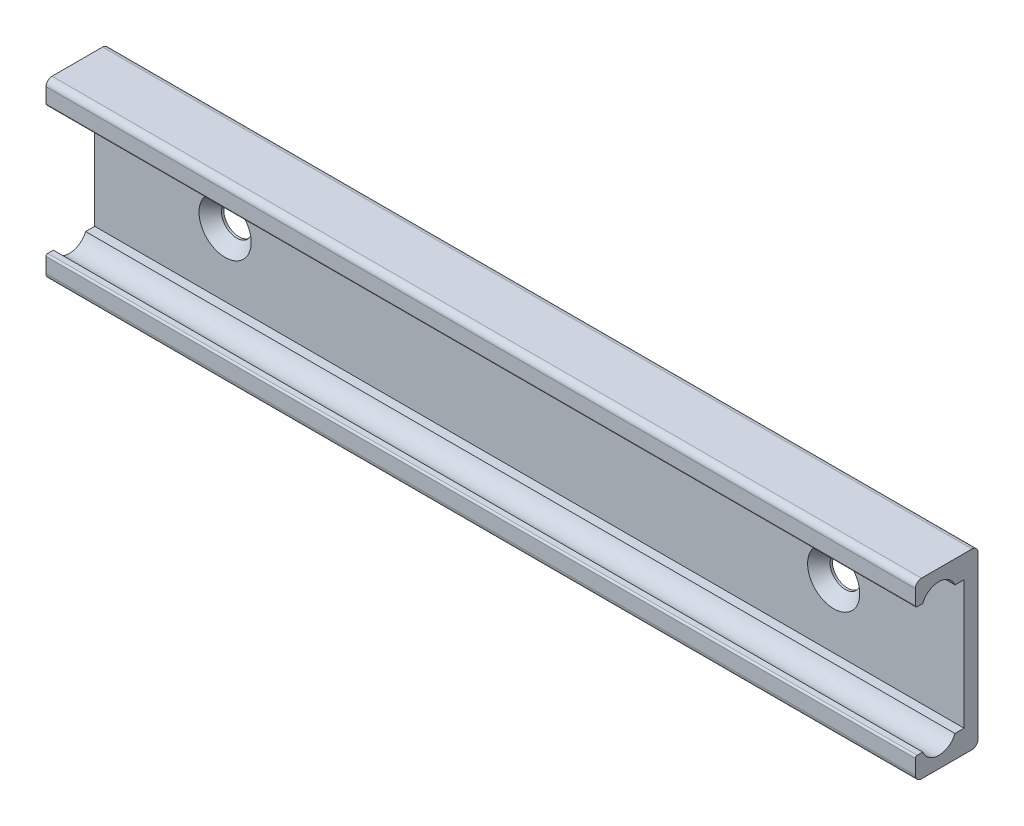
ISO-10303-21;
HEADER;
FILE_DESCRIPTION(('STEP AP214'),'2;1');
FILE_NAME('part.step','',(''),(''),'','','');
FILE_SCHEMA(('AUTOMOTIVE_DESIGN { 1 0 10303 214 1 1 1 1 }'));
ENDSEC;
DATA;
#1=APPLICATION_CONTEXT('core data for automotive mechanical design processes');
#2=APPLICATION_PROTOCOL_DEFINITION('international standard','automotive_design',2000,#1);
#3=PRODUCT_CONTEXT('',#1,'mechanical');
#4=PRODUCT('Part','Part','',(#3));
#5=PRODUCT_RELATED_PRODUCT_CATEGORY('part','',(#4));
#6=PRODUCT_DEFINITION_FORMATION('','',#4);
#7=PRODUCT_DEFINITION_CONTEXT('part definition',#1,'design');
#8=PRODUCT_DEFINITION('design','',#6,#7);
#9=PRODUCT_DEFINITION_SHAPE('','',#8);
#10=(LENGTH_UNIT() NAMED_UNIT(*) SI_UNIT(.MILLI.,.METRE.));
#11=(NAMED_UNIT(*) PLANE_ANGLE_UNIT() SI_UNIT($,.RADIAN.));
#12=(NAMED_UNIT(*) SI_UNIT($,.STERADIAN.) SOLID_ANGLE_UNIT());
#13=UNCERTAINTY_MEASURE_WITH_UNIT(LENGTH_MEASURE(1.E-05),#10,'distance_accuracy_value','');
#14=(GEOMETRIC_REPRESENTATION_CONTEXT(3) GLOBAL_UNCERTAINTY_ASSIGNED_CONTEXT((#13)) GLOBAL_UNIT_ASSIGNED_CONTEXT((#10,
#11,#12)) REPRESENTATION_CONTEXT('',''));
#15=CARTESIAN_POINT('',(0.,0.,0.));
#16=DIRECTION('',(0.,0.,1.));
#17=DIRECTION('',(1.,0.,0.));
#18=AXIS2_PLACEMENT_3D('',#15,#16,#17);
#19=CARTESIAN_POINT('',(85.,9.3,6.49999999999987));
#20=DIRECTION('',(-1.,0.,0.));
#21=DIRECTION('',(0.,0.,1.));
#22=AXIS2_PLACEMENT_3D('',#19,#20,#21);
#23=CYLINDRICAL_SURFACE('',#22,0.7);
#24=CARTESIAN_POINT('',(-15.,9.3,6.49999999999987));
#25=DIRECTION('',(-1.,0.,0.));
#26=DIRECTION('',(0.,0.,-1.));
#27=AXIS2_PLACEMENT_3D('',#24,#25,#26);
#28=CIRCLE('',#27,0.7);
#29=CARTESIAN_POINT('',(-15.,9.3,7.19999999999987));
#30=VERTEX_POINT('',#29);
#31=CARTESIAN_POINT('',(-15.,10.,6.49999999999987));
#32=VERTEX_POINT('',#31);
#33=EDGE_CURVE('E139',#30,#32,#28,.T.);
#34=ORIENTED_EDGE('',*,*,#33,.F.);
#35=DIRECTION('',(-1.,0.,0.));
#36=VECTOR('',#35,1.);
#37=CARTESIAN_POINT('',(85.,9.3,7.19999999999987));
#38=LINE('',#37,#36);
#39=CARTESIAN_POINT('',(85.,9.3,7.19999999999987));
#40=VERTEX_POINT('',#39);
#41=EDGE_CURVE('E9',#40,#30,#38,.T.);
#42=ORIENTED_EDGE('',*,*,#41,.F.);
#43=CARTESIAN_POINT('',(85.,9.3,6.49999999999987));
#44=DIRECTION('',(-1.,0.,0.));
#45=DIRECTION('',(0.,0.,-1.));
#46=AXIS2_PLACEMENT_3D('',#43,#44,#45);
#47=CIRCLE('',#46,0.7);
#48=CARTESIAN_POINT('',(85.,10.,6.49999999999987));
#49=VERTEX_POINT('',#48);
#50=EDGE_CURVE('E141',#40,#49,#47,.T.);
#51=ORIENTED_EDGE('',*,*,#50,.T.);
#52=DIRECTION('',(-1.,0.,0.));
#53=VECTOR('',#52,1.);
#54=CARTESIAN_POINT('',(85.,10.,6.49999999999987));
#55=LINE('',#54,#53);
#56=EDGE_CURVE('E136',#49,#32,#55,.T.);
#57=ORIENTED_EDGE('',*,*,#56,.T.);
#58=EDGE_LOOP('',(#34,#42,#51,#57));
#59=FACE_BOUND('',#58,.T.);
#60=ADVANCED_FACE('F14',(#59),#23,.T.);
#61=CARTESIAN_POINT('',(85.,7.60000008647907,7.19999999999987));
#62=DIRECTION('',(0.,0.,1.));
#63=DIRECTION('',(1.,0.,0.));
#64=AXIS2_PLACEMENT_3D('',#61,#62,#63);
#65=PLANE('',#64);
#66=DIRECTION('',(0.,1.,0.));
#67=VECTOR('',#66,1.);
#68=CARTESIAN_POINT('',(-15.,7.60000008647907,7.19999999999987));
#69=LINE('',#68,#67);
#70=CARTESIAN_POINT('',(-15.,7.60000008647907,7.19999999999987));
#71=VERTEX_POINT('',#70);
#72=EDGE_CURVE('E158',#71,#30,#69,.T.);
#73=ORIENTED_EDGE('',*,*,#72,.F.);
#74=DIRECTION('',(-1.,0.,0.));
#75=VECTOR('',#74,1.);
#76=CARTESIAN_POINT('',(85.,7.60000008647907,7.19999999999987));
#77=LINE('',#76,#75);
#78=CARTESIAN_POINT('',(85.,7.60000008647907,7.19999999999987));
#79=VERTEX_POINT('',#78);
#80=EDGE_CURVE('E22',#79,#71,#77,.T.);
#81=ORIENTED_EDGE('',*,*,#80,.F.);
#82=DIRECTION('',(0.,1.,0.));
#83=VECTOR('',#82,1.);
#84=CARTESIAN_POINT('',(85.,7.60000008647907,7.19999999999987));
#85=LINE('',#84,#83);
#86=EDGE_CURVE('E146',#79,#40,#85,.T.);
#87=ORIENTED_EDGE('',*,*,#86,.T.);
#88=ORIENTED_EDGE('',*,*,#41,.T.);
#89=EDGE_LOOP('',(#73,#81,#87,#88));
#90=FACE_BOUND('',#89,.T.);
#91=ADVANCED_FACE('F319',(#90),#65,.T.);
#92=CARTESIAN_POINT('',(85.,7.60000008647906,6.99999999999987));
#93=DIRECTION('',(-1.,0.,0.));
#94=DIRECTION('',(0.,0.,1.));
#95=AXIS2_PLACEMENT_3D('',#92,#93,#94);
#96=CYLINDRICAL_SURFACE('',#95,0.2);
#97=CARTESIAN_POINT('',(-15.,7.60000008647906,6.99999999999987));
#98=DIRECTION('',(-1.,0.,0.));
#99=DIRECTION('',(0.,0.,-1.));
#100=AXIS2_PLACEMENT_3D('',#97,#98,#99);
#101=CIRCLE('',#100,0.2);
#102=CARTESIAN_POINT('',(-15.,7.40000008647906,6.99999999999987));
#103=VERTEX_POINT('',#102);
#104=EDGE_CURVE('E206',#103,#71,#101,.T.);
#105=ORIENTED_EDGE('',*,*,#104,.F.);
#106=DIRECTION('',(-1.,0.,0.));
#107=VECTOR('',#106,1.);
#108=CARTESIAN_POINT('',(85.,7.40000008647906,6.99999999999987));
#109=LINE('',#108,#107);
#110=CARTESIAN_POINT('',(85.,7.40000008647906,6.99999999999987));
#111=VERTEX_POINT('',#110);
#112=EDGE_CURVE('E258',#111,#103,#109,.T.);
#113=ORIENTED_EDGE('',*,*,#112,.F.);
#114=CARTESIAN_POINT('',(85.,7.60000008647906,6.99999999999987));
#115=DIRECTION('',(-1.,0.,0.));
#116=DIRECTION('',(0.,0.,-1.));
#117=AXIS2_PLACEMENT_3D('',#114,#115,#116);
#118=CIRCLE('',#117,0.2);
#119=EDGE_CURVE('E254',#111,#79,#118,.T.);
#120=ORIENTED_EDGE('',*,*,#119,.T.);
#121=ORIENTED_EDGE('',*,*,#80,.T.);
#122=EDGE_LOOP('',(#105,#113,#120,#121));
#123=FACE_BOUND('',#122,.T.);
#124=ADVANCED_FACE('F324',(#123),#96,.T.);
#125=CARTESIAN_POINT('',(85.,7.40000008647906,6.35404949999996));
#126=DIRECTION('',(0.,-1.,0.));
#127=DIRECTION('',(1.,0.,0.));
#128=AXIS2_PLACEMENT_3D('',#125,#126,#127);
#129=PLANE('',#128);
#130=DIRECTION('',(0.,0.,1.));
#131=VECTOR('',#130,1.);
#132=CARTESIAN_POINT('',(-15.,7.40000008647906,6.35404949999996));
#133=LINE('',#132,#131);
#134=CARTESIAN_POINT('',(-15.,7.40000008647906,6.35404949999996));
#135=VERTEX_POINT('',#134);
#136=EDGE_CURVE('E203',#135,#103,#133,.T.);
#137=ORIENTED_EDGE('',*,*,#136,.F.);
#138=DIRECTION('',(-1.,0.,0.));
#139=VECTOR('',#138,1.);
#140=CARTESIAN_POINT('',(85.,7.40000008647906,6.35404949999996));
#141=LINE('',#140,#139);
#142=CARTESIAN_POINT('',(85.,7.40000008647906,6.35404949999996));
#143=VERTEX_POINT('',#142);
#144=EDGE_CURVE('E260',#143,#135,#141,.T.);
#145=ORIENTED_EDGE('',*,*,#144,.F.);
#146=DIRECTION('',(0.,0.,1.));
#147=VECTOR('',#146,1.);
#148=CARTESIAN_POINT('',(85.,7.40000008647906,6.35404949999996));
#149=LINE('',#148,#147);
#150=EDGE_CURVE('E251',#143,#111,#149,.T.);
#151=ORIENTED_EDGE('',*,*,#150,.T.);
#152=ORIENTED_EDGE('',*,*,#112,.T.);
#153=EDGE_LOOP('',(#137,#145,#151,#152));
#154=FACE_BOUND('',#153,.T.);
#155=ADVANCED_FACE('F330',(#154),#129,.T.);
#156=CARTESIAN_POINT('',(85.,6.65000008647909,4.50000000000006));
#157=DIRECTION('',(-1.,0.,0.));
#158=DIRECTION('',(0.,0.,1.));
#159=AXIS2_PLACEMENT_3D('',#156,#157,#158);
#160=CYLINDRICAL_SURFACE('',#159,1.99999988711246);
#161=CARTESIAN_POINT('',(-15.,6.65000008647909,4.50000000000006));
#162=DIRECTION('',(1.,0.,0.));
#163=DIRECTION('',(0.,0.,1.));
#164=AXIS2_PLACEMENT_3D('',#161,#162,#163);
#165=CIRCLE('',#164,1.99999988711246);
#166=CARTESIAN_POINT('',(-15.,7.40000008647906,2.64595050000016));
#167=VERTEX_POINT('',#166);
#168=EDGE_CURVE('E200',#167,#135,#165,.T.);
#169=ORIENTED_EDGE('',*,*,#168,.F.);
#170=DIRECTION('',(-1.,0.,0.));
#171=VECTOR('',#170,1.);
#172=CARTESIAN_POINT('',(85.,7.40000008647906,2.64595050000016));
#173=LINE('',#172,#171);
#174=CARTESIAN_POINT('',(85.,7.40000008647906,2.64595050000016));
#175=VERTEX_POINT('',#174);
#176=EDGE_CURVE('E262',#175,#167,#173,.T.);
#177=ORIENTED_EDGE('',*,*,#176,.F.);
#178=CARTESIAN_POINT('',(85.,6.65000008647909,4.50000000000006));
#179=DIRECTION('',(1.,0.,0.));
#180=DIRECTION('',(0.,0.,1.));
#181=AXIS2_PLACEMENT_3D('',#178,#179,#180);
#182=CIRCLE('',#181,1.99999988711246);
#183=EDGE_CURVE('E248',#175,#143,#182,.T.);
#184=ORIENTED_EDGE('',*,*,#183,.T.);
#185=ORIENTED_EDGE('',*,*,#144,.T.);
#186=EDGE_LOOP('',(#169,#177,#184,#185));
#187=FACE_BOUND('',#186,.T.);
#188=ADVANCED_FACE('F339',(#187),#160,.F.);
#189=CARTESIAN_POINT('',(85.,7.40000008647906,1.60000000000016));
#190=DIRECTION('',(0.,-1.,0.));
#191=DIRECTION('',(1.,0.,0.));
#192=AXIS2_PLACEMENT_3D('',#189,#190,#191);
#193=PLANE('',#192);
#194=DIRECTION('',(0.,0.,1.));
#195=VECTOR('',#194,1.);
#196=CARTESIAN_POINT('',(-15.,7.40000008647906,1.60000000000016));
#197=LINE('',#196,#195);
#198=CARTESIAN_POINT('',(-15.,7.40000008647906,1.60000000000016));
#199=VERTEX_POINT('',#198);
#200=EDGE_CURVE('E197',#199,#167,#197,.T.);
#201=ORIENTED_EDGE('',*,*,#200,.F.);
#202=DIRECTION('',(-1.,0.,0.));
#203=VECTOR('',#202,1.);
#204=CARTESIAN_POINT('',(85.,7.40000008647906,1.60000000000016));
#205=LINE('',#204,#203);
#206=CARTESIAN_POINT('',(85.,7.40000008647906,1.60000000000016));
#207=VERTEX_POINT('',#206);
#208=EDGE_CURVE('E264',#207,#199,#205,.T.);
#209=ORIENTED_EDGE('',*,*,#208,.F.);
#210=DIRECTION('',(0.,0.,1.));
#211=VECTOR('',#210,1.);
#212=CARTESIAN_POINT('',(85.,7.40000008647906,1.60000000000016));
#213=LINE('',#212,#211);
#214=EDGE_CURVE('E245',#207,#175,#213,.T.);
#215=ORIENTED_EDGE('',*,*,#214,.T.);
#216=ORIENTED_EDGE('',*,*,#176,.T.);
#217=EDGE_LOOP('',(#201,#209,#215,#216));
#218=FACE_BOUND('',#217,.T.);
#219=ADVANCED_FACE('F343',(#218),#193,.T.);
#220=CARTESIAN_POINT('',(85.,-7.40000008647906,1.60000000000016));
#221=DIRECTION('',(0.,0.,1.));
#222=DIRECTION('',(0.,1.,0.));
#223=AXIS2_PLACEMENT_3D('',#220,#221,#222);
#224=PLANE('',#223);
#225=CARTESIAN_POINT('',(70.,0.,1.60000000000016));
#226=DIRECTION('',(0.,0.,1.));
#227=DIRECTION('',(0.,1.,0.));
#228=AXIS2_PLACEMENT_3D('',#225,#226,#227);
#229=CIRCLE('',#228,3.);
#230=CARTESIAN_POINT('',(70.,3.,1.60000000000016));
#231=VERTEX_POINT('',#230);
#232=EDGE_CURVE('E291',#231,#231,#229,.T.);
#233=ORIENTED_EDGE('',*,*,#232,.F.);
#234=EDGE_LOOP('',(#233));
#235=FACE_BOUND('',#234,.T.);
#236=CARTESIAN_POINT('',(0.,0.,1.60000000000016));
#237=DIRECTION('',(0.,0.,1.));
#238=DIRECTION('',(0.,1.,0.));
#239=AXIS2_PLACEMENT_3D('',#236,#237,#238);
#240=CIRCLE('',#239,3.);
#241=CARTESIAN_POINT('',(0.,3.,1.60000000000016));
#242=VERTEX_POINT('',#241);
#243=EDGE_CURVE('E159',#242,#242,#240,.T.);
#244=ORIENTED_EDGE('',*,*,#243,.F.);
#245=EDGE_LOOP('',(#244));
#246=FACE_BOUND('',#245,.T.);
#247=DIRECTION('',(0.,1.,0.));
#248=VECTOR('',#247,1.);
#249=CARTESIAN_POINT('',(-15.,-7.40000008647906,1.60000000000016));
#250=LINE('',#249,#248);
#251=CARTESIAN_POINT('',(-15.,-7.40000008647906,1.60000000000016));
#252=VERTEX_POINT('',#251);
#253=EDGE_CURVE('E194',#252,#199,#250,.T.);
#254=ORIENTED_EDGE('',*,*,#253,.F.);
#255=DIRECTION('',(-1.,0.,0.));
#256=VECTOR('',#255,1.);
#257=CARTESIAN_POINT('',(85.,-7.40000008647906,1.60000000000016));
#258=LINE('',#257,#256);
#259=CARTESIAN_POINT('',(85.,-7.40000008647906,1.60000000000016));
#260=VERTEX_POINT('',#259);
#261=EDGE_CURVE('E266',#260,#252,#258,.T.);
#262=ORIENTED_EDGE('',*,*,#261,.F.);
#263=DIRECTION('',(0.,1.,0.));
#264=VECTOR('',#263,1.);
#265=CARTESIAN_POINT('',(85.,-7.40000008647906,1.60000000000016));
#266=LINE('',#265,#264);
#267=EDGE_CURVE('E242',#260,#207,#266,.T.);
#268=ORIENTED_EDGE('',*,*,#267,.T.);
#269=ORIENTED_EDGE('',*,*,#208,.T.);
#270=EDGE_LOOP('',(#254,#262,#268,#269));
#271=FACE_BOUND('',#270,.T.);
#272=ADVANCED_FACE('F347',(#235,#246,#271),#224,.T.);
#273=CARTESIAN_POINT('',(85.,-7.40000008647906,1.60000000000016));
#274=DIRECTION('',(0.,1.,0.));
#275=DIRECTION('',(-1.,0.,0.));
#276=AXIS2_PLACEMENT_3D('',#273,#274,#275);
#277=PLANE('',#276);
#278=DIRECTION('',(0.,0.,-1.));
#279=VECTOR('',#278,1.);
#280=CARTESIAN_POINT('',(-15.,-7.40000008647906,1.60000000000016));
#281=LINE('',#280,#279);
#282=CARTESIAN_POINT('',(-15.,-7.40000008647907,2.64595050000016));
#283=VERTEX_POINT('',#282);
#284=EDGE_CURVE('E191',#283,#252,#281,.T.);
#285=ORIENTED_EDGE('',*,*,#284,.F.);
#286=DIRECTION('',(-1.,0.,0.));
#287=VECTOR('',#286,1.);
#288=CARTESIAN_POINT('',(85.,-7.40000008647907,2.64595050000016));
#289=LINE('',#288,#287);
#290=CARTESIAN_POINT('',(85.,-7.40000008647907,2.64595050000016));
#291=VERTEX_POINT('',#290);
#292=EDGE_CURVE('E268',#291,#283,#289,.T.);
#293=ORIENTED_EDGE('',*,*,#292,.F.);
#294=DIRECTION('',(0.,0.,-1.));
#295=VECTOR('',#294,1.);
#296=CARTESIAN_POINT('',(85.,-7.40000008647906,1.60000000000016));
#297=LINE('',#296,#295);
#298=EDGE_CURVE('E239',#291,#260,#297,.T.);
#299=ORIENTED_EDGE('',*,*,#298,.T.);
#300=ORIENTED_EDGE('',*,*,#261,.T.);
#301=EDGE_LOOP('',(#285,#293,#299,#300));
#302=FACE_BOUND('',#301,.T.);
#303=ADVANCED_FACE('F351',(#302),#277,.T.);
#304=CARTESIAN_POINT('',(85.,-6.65000008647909,4.50000000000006));
#305=DIRECTION('',(-1.,0.,0.));
#306=DIRECTION('',(0.,0.,1.));
#307=AXIS2_PLACEMENT_3D('',#304,#305,#306);
#308=CYLINDRICAL_SURFACE('',#307,1.99999988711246);
#309=CARTESIAN_POINT('',(-15.,-6.65000008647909,4.50000000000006));
#310=DIRECTION('',(1.,0.,0.));
#311=DIRECTION('',(0.,0.,-1.));
#312=AXIS2_PLACEMENT_3D('',#309,#310,#311);
#313=CIRCLE('',#312,1.99999988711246);
#314=CARTESIAN_POINT('',(-15.,-7.40000008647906,6.35404949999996));
#315=VERTEX_POINT('',#314);
#316=EDGE_CURVE('E188',#315,#283,#313,.T.);
#317=ORIENTED_EDGE('',*,*,#316,.F.);
#318=DIRECTION('',(-1.,0.,0.));
#319=VECTOR('',#318,1.);
#320=CARTESIAN_POINT('',(85.,-7.40000008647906,6.35404949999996));
#321=LINE('',#320,#319);
#322=CARTESIAN_POINT('',(85.,-7.40000008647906,6.35404949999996));
#323=VERTEX_POINT('',#322);
#324=EDGE_CURVE('E270',#323,#315,#321,.T.);
#325=ORIENTED_EDGE('',*,*,#324,.F.);
#326=CARTESIAN_POINT('',(85.,-6.65000008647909,4.50000000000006));
#327=DIRECTION('',(1.,0.,0.));
#328=DIRECTION('',(0.,0.,-1.));
#329=AXIS2_PLACEMENT_3D('',#326,#327,#328);
#330=CIRCLE('',#329,1.99999988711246);
#331=EDGE_CURVE('E236',#323,#291,#330,.T.);
#332=ORIENTED_EDGE('',*,*,#331,.T.);
#333=ORIENTED_EDGE('',*,*,#292,.T.);
#334=EDGE_LOOP('',(#317,#325,#332,#333));
#335=FACE_BOUND('',#334,.T.);
#336=ADVANCED_FACE('F355',(#335),#308,.F.);
#337=CARTESIAN_POINT('',(85.,-7.40000008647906,6.35404949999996));
#338=DIRECTION('',(0.,1.,0.));
#339=DIRECTION('',(-1.,0.,0.));
#340=AXIS2_PLACEMENT_3D('',#337,#338,#339);
#341=PLANE('',#340);
#342=DIRECTION('',(0.,0.,-1.));
#343=VECTOR('',#342,1.);
#344=CARTESIAN_POINT('',(-15.,-7.40000008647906,6.35404949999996));
#345=LINE('',#344,#343);
#346=CARTESIAN_POINT('',(-15.,-7.40000008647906,6.99999999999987));
#347=VERTEX_POINT('',#346);
#348=EDGE_CURVE('E185',#347,#315,#345,.T.);
#349=ORIENTED_EDGE('',*,*,#348,.F.);
#350=DIRECTION('',(-1.,0.,0.));
#351=VECTOR('',#350,1.);
#352=CARTESIAN_POINT('',(85.,-7.40000008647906,6.99999999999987));
#353=LINE('',#352,#351);
#354=CARTESIAN_POINT('',(85.,-7.40000008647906,6.99999999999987));
#355=VERTEX_POINT('',#354);
#356=EDGE_CURVE('E272',#355,#347,#353,.T.);
#357=ORIENTED_EDGE('',*,*,#356,.F.);
#358=DIRECTION('',(0.,0.,-1.));
#359=VECTOR('',#358,1.);
#360=CARTESIAN_POINT('',(85.,-7.40000008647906,6.35404949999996));
#361=LINE('',#360,#359);
#362=EDGE_CURVE('E233',#355,#323,#361,.T.);
#363=ORIENTED_EDGE('',*,*,#362,.T.);
#364=ORIENTED_EDGE('',*,*,#324,.T.);
#365=EDGE_LOOP('',(#349,#357,#363,#364));
#366=FACE_BOUND('',#365,.T.);
#367=ADVANCED_FACE('F359',(#366),#341,.T.);
#368=CARTESIAN_POINT('',(85.,-7.60000008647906,6.99999999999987));
#369=DIRECTION('',(-1.,0.,0.));
#370=DIRECTION('',(0.,0.,1.));
#371=AXIS2_PLACEMENT_3D('',#368,#369,#370);
#372=CYLINDRICAL_SURFACE('',#371,0.2);
#373=CARTESIAN_POINT('',(-15.,-7.60000008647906,6.99999999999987));
#374=DIRECTION('',(-1.,0.,0.));
#375=DIRECTION('',(0.,0.,1.));
#376=AXIS2_PLACEMENT_3D('',#373,#374,#375);
#377=CIRCLE('',#376,0.2);
#378=CARTESIAN_POINT('',(-15.,-7.60000008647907,7.19999999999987));
#379=VERTEX_POINT('',#378);
#380=EDGE_CURVE('E182',#379,#347,#377,.T.);
#381=ORIENTED_EDGE('',*,*,#380,.F.);
#382=DIRECTION('',(-1.,0.,0.));
#383=VECTOR('',#382,1.);
#384=CARTESIAN_POINT('',(85.,-7.60000008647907,7.19999999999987));
#385=LINE('',#384,#383);
#386=CARTESIAN_POINT('',(85.,-7.60000008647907,7.19999999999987));
#387=VERTEX_POINT('',#386);
#388=EDGE_CURVE('E274',#387,#379,#385,.T.);
#389=ORIENTED_EDGE('',*,*,#388,.F.);
#390=CARTESIAN_POINT('',(85.,-7.60000008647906,6.99999999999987));
#391=DIRECTION('',(-1.,0.,0.));
#392=DIRECTION('',(0.,0.,1.));
#393=AXIS2_PLACEMENT_3D('',#390,#391,#392);
#394=CIRCLE('',#393,0.2);
#395=EDGE_CURVE('E230',#387,#355,#394,.T.);
#396=ORIENTED_EDGE('',*,*,#395,.T.);
#397=ORIENTED_EDGE('',*,*,#356,.T.);
#398=EDGE_LOOP('',(#381,#389,#396,#397));
#399=FACE_BOUND('',#398,.T.);
#400=ADVANCED_FACE('F363',(#399),#372,.T.);
#401=CARTESIAN_POINT('',(85.,-7.60000008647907,7.19999999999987));
#402=DIRECTION('',(0.,0.,1.));
#403=DIRECTION('',(1.,0.,0.));
#404=AXIS2_PLACEMENT_3D('',#401,#402,#403);
#405=PLANE('',#404);
#406=DIRECTION('',(0.,1.,0.));
#407=VECTOR('',#406,1.);
#408=CARTESIAN_POINT('',(-15.,-7.60000008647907,7.19999999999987));
#409=LINE('',#408,#407);
#410=CARTESIAN_POINT('',(-15.,-9.3,7.19999999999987));
#411=VERTEX_POINT('',#410);
#412=EDGE_CURVE('E179',#411,#379,#409,.T.);
#413=ORIENTED_EDGE('',*,*,#412,.F.);
#414=DIRECTION('',(-1.,0.,0.));
#415=VECTOR('',#414,1.);
#416=CARTESIAN_POINT('',(85.,-9.3,7.19999999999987));
#417=LINE('',#416,#415);
#418=CARTESIAN_POINT('',(85.,-9.3,7.19999999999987));
#419=VERTEX_POINT('',#418);
#420=EDGE_CURVE('E276',#419,#411,#417,.T.);
#421=ORIENTED_EDGE('',*,*,#420,.F.);
#422=DIRECTION('',(0.,1.,0.));
#423=VECTOR('',#422,1.);
#424=CARTESIAN_POINT('',(85.,-7.60000008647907,7.19999999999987));
#425=LINE('',#424,#423);
#426=EDGE_CURVE('E227',#419,#387,#425,.T.);
#427=ORIENTED_EDGE('',*,*,#426,.T.);
#428=ORIENTED_EDGE('',*,*,#388,.T.);
#429=EDGE_LOOP('',(#413,#421,#427,#428));
#430=FACE_BOUND('',#429,.T.);
#431=ADVANCED_FACE('F367',(#430),#405,.T.);
#432=CARTESIAN_POINT('',(85.,-9.3,6.49999999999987));
#433=DIRECTION('',(-1.,0.,0.));
#434=DIRECTION('',(0.,0.,1.));
#435=AXIS2_PLACEMENT_3D('',#432,#433,#434);
#436=CYLINDRICAL_SURFACE('',#435,0.7);
#437=CARTESIAN_POINT('',(-15.,-9.3,6.49999999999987));
#438=DIRECTION('',(-1.,0.,0.));
#439=DIRECTION('',(0.,0.,1.));
#440=AXIS2_PLACEMENT_3D('',#437,#438,#439);
#441=CIRCLE('',#440,0.7);
#442=CARTESIAN_POINT('',(-15.,-10.,6.49999999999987));
#443=VERTEX_POINT('',#442);
#444=EDGE_CURVE('E176',#443,#411,#441,.T.);
#445=ORIENTED_EDGE('',*,*,#444,.F.);
#446=DIRECTION('',(-1.,0.,0.));
#447=VECTOR('',#446,1.);
#448=CARTESIAN_POINT('',(85.,-10.,6.49999999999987));
#449=LINE('',#448,#447);
#450=CARTESIAN_POINT('',(85.,-10.,6.49999999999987));
#451=VERTEX_POINT('',#450);
#452=EDGE_CURVE('E278',#451,#443,#449,.T.);
#453=ORIENTED_EDGE('',*,*,#452,.F.);
#454=CARTESIAN_POINT('',(85.,-9.3,6.49999999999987));
#455=DIRECTION('',(-1.,0.,0.));
#456=DIRECTION('',(0.,0.,1.));
#457=AXIS2_PLACEMENT_3D('',#454,#455,#456);
#458=CIRCLE('',#457,0.7);
#459=EDGE_CURVE('E224',#451,#419,#458,.T.);
#460=ORIENTED_EDGE('',*,*,#459,.T.);
#461=ORIENTED_EDGE('',*,*,#420,.T.);
#462=EDGE_LOOP('',(#445,#453,#460,#461));
#463=FACE_BOUND('',#462,.T.);
#464=ADVANCED_FACE('F371',(#463),#436,.T.);
#465=CARTESIAN_POINT('',(85.,-10.,0.7));
#466=DIRECTION('',(0.,-1.,0.));
#467=DIRECTION('',(1.,0.,0.));
#468=AXIS2_PLACEMENT_3D('',#465,#466,#467);
#469=PLANE('',#468);
#470=DIRECTION('',(0.,0.,1.));
#471=VECTOR('',#470,1.);
#472=CARTESIAN_POINT('',(-15.,-10.,0.7));
#473=LINE('',#472,#471);
#474=CARTESIAN_POINT('',(-15.,-10.,0.7));
#475=VERTEX_POINT('',#474);
#476=EDGE_CURVE('E173',#475,#443,#473,.T.);
#477=ORIENTED_EDGE('',*,*,#476,.F.);
#478=DIRECTION('',(-1.,0.,0.));
#479=VECTOR('',#478,1.);
#480=CARTESIAN_POINT('',(85.,-10.,0.7));
#481=LINE('',#480,#479);
#482=CARTESIAN_POINT('',(85.,-10.,0.7));
#483=VERTEX_POINT('',#482);
#484=EDGE_CURVE('E280',#483,#475,#481,.T.);
#485=ORIENTED_EDGE('',*,*,#484,.F.);
#486=DIRECTION('',(0.,0.,1.));
#487=VECTOR('',#486,1.);
#488=CARTESIAN_POINT('',(85.,-10.,0.7));
#489=LINE('',#488,#487);
#490=EDGE_CURVE('E221',#483,#451,#489,.T.);
#491=ORIENTED_EDGE('',*,*,#490,.T.);
#492=ORIENTED_EDGE('',*,*,#452,.T.);
#493=EDGE_LOOP('',(#477,#485,#491,#492));
#494=FACE_BOUND('',#493,.T.);
#495=ADVANCED_FACE('F375',(#494),#469,.T.);
#496=CARTESIAN_POINT('',(85.,-9.3,0.7));
#497=DIRECTION('',(-1.,0.,0.));
#498=DIRECTION('',(0.,0.,1.));
#499=AXIS2_PLACEMENT_3D('',#496,#497,#498);
#500=CYLINDRICAL_SURFACE('',#499,0.7);
#501=CARTESIAN_POINT('',(-15.,-9.3,0.7));
#502=DIRECTION('',(-1.,0.,0.));
#503=DIRECTION('',(0.,0.,1.));
#504=AXIS2_PLACEMENT_3D('',#501,#502,#503);
#505=CIRCLE('',#504,0.7);
#506=CARTESIAN_POINT('',(-15.,-9.3,0.));
#507=VERTEX_POINT('',#506);
#508=EDGE_CURVE('E170',#507,#475,#505,.T.);
#509=ORIENTED_EDGE('',*,*,#508,.F.);
#510=DIRECTION('',(-1.,0.,0.));
#511=VECTOR('',#510,1.);
#512=CARTESIAN_POINT('',(85.,-9.3,0.));
#513=LINE('',#512,#511);
#514=CARTESIAN_POINT('',(85.,-9.3,0.));
#515=VERTEX_POINT('',#514);
#516=EDGE_CURVE('E282',#515,#507,#513,.T.);
#517=ORIENTED_EDGE('',*,*,#516,.F.);
#518=CARTESIAN_POINT('',(85.,-9.3,0.7));
#519=DIRECTION('',(-1.,0.,0.));
#520=DIRECTION('',(0.,0.,1.));
#521=AXIS2_PLACEMENT_3D('',#518,#519,#520);
#522=CIRCLE('',#521,0.7);
#523=EDGE_CURVE('E218',#515,#483,#522,.T.);
#524=ORIENTED_EDGE('',*,*,#523,.T.);
#525=ORIENTED_EDGE('',*,*,#484,.T.);
#526=EDGE_LOOP('',(#509,#517,#524,#525));
#527=FACE_BOUND('',#526,.T.);
#528=ADVANCED_FACE('F379',(#527),#500,.T.);
#529=CARTESIAN_POINT('',(85.,-9.3,0.));
#530=DIRECTION('',(0.,0.,-1.));
#531=DIRECTION('',(-1.,0.,0.));
#532=AXIS2_PLACEMENT_3D('',#529,#530,#531);
#533=PLANE('',#532);
#534=CARTESIAN_POINT('',(70.,0.,0.));
#535=DIRECTION('',(0.,0.,1.));
#536=DIRECTION('',(0.,1.,0.));
#537=AXIS2_PLACEMENT_3D('',#534,#535,#536);
#538=CIRCLE('',#537,1.75);
#539=CARTESIAN_POINT('',(70.,1.75,0.));
#540=VERTEX_POINT('',#539);
#541=EDGE_CURVE('E297',#540,#540,#538,.T.);
#542=ORIENTED_EDGE('',*,*,#541,.T.);
#543=EDGE_LOOP('',(#542));
#544=FACE_BOUND('',#543,.T.);
#545=CARTESIAN_POINT('',(0.,0.,0.));
#546=DIRECTION('',(0.,0.,1.));
#547=DIRECTION('',(0.,1.,0.));
#548=AXIS2_PLACEMENT_3D('',#545,#546,#547);
#549=CIRCLE('',#548,1.75);
#550=CARTESIAN_POINT('',(0.,1.75,0.));
#551=VERTEX_POINT('',#550);
#552=EDGE_CURVE('E287',#551,#551,#549,.T.);
#553=ORIENTED_EDGE('',*,*,#552,.T.);
#554=EDGE_LOOP('',(#553));
#555=FACE_BOUND('',#554,.T.);
#556=DIRECTION('',(0.,-1.,0.));
#557=VECTOR('',#556,1.);
#558=CARTESIAN_POINT('',(-15.,-9.3,0.));
#559=LINE('',#558,#557);
#560=CARTESIAN_POINT('',(-15.,9.3,0.));
#561=VERTEX_POINT('',#560);
#562=EDGE_CURVE('E167',#561,#507,#559,.T.);
#563=ORIENTED_EDGE('',*,*,#562,.F.);
#564=DIRECTION('',(-1.,0.,0.));
#565=VECTOR('',#564,1.);
#566=CARTESIAN_POINT('',(85.,9.3,0.));
#567=LINE('',#566,#565);
#568=CARTESIAN_POINT('',(85.,9.3,0.));
#569=VERTEX_POINT('',#568);
#570=EDGE_CURVE('E284',#569,#561,#567,.T.);
#571=ORIENTED_EDGE('',*,*,#570,.F.);
#572=DIRECTION('',(0.,-1.,0.));
#573=VECTOR('',#572,1.);
#574=CARTESIAN_POINT('',(85.,-9.3,0.));
#575=LINE('',#574,#573);
#576=EDGE_CURVE('E215',#569,#515,#575,.T.);
#577=ORIENTED_EDGE('',*,*,#576,.T.);
#578=ORIENTED_EDGE('',*,*,#516,.T.);
#579=EDGE_LOOP('',(#563,#571,#577,#578));
#580=FACE_BOUND('',#579,.T.);
#581=ADVANCED_FACE('F383',(#544,#555,#580),#533,.T.);
#582=CARTESIAN_POINT('',(85.,9.3,0.7));
#583=DIRECTION('',(-1.,0.,0.));
#584=DIRECTION('',(0.,0.,1.));
#585=AXIS2_PLACEMENT_3D('',#582,#583,#584);
#586=CYLINDRICAL_SURFACE('',#585,0.7);
#587=CARTESIAN_POINT('',(-15.,9.3,0.7));
#588=DIRECTION('',(-1.,0.,0.));
#589=DIRECTION('',(0.,0.,-1.));
#590=AXIS2_PLACEMENT_3D('',#587,#588,#589);
#591=CIRCLE('',#590,0.7);
#592=CARTESIAN_POINT('',(-15.,10.,0.7));
#593=VERTEX_POINT('',#592);
#594=EDGE_CURVE('E154',#593,#561,#591,.T.);
#595=ORIENTED_EDGE('',*,*,#594,.F.);
#596=DIRECTION('',(-1.,0.,0.));
#597=VECTOR('',#596,1.);
#598=CARTESIAN_POINT('',(85.,10.,0.7));
#599=LINE('',#598,#597);
#600=CARTESIAN_POINT('',(85.,10.,0.7));
#601=VERTEX_POINT('',#600);
#602=EDGE_CURVE('E145',#601,#593,#599,.T.);
#603=ORIENTED_EDGE('',*,*,#602,.F.);
#604=CARTESIAN_POINT('',(85.,9.3,0.7));
#605=DIRECTION('',(-1.,0.,0.));
#606=DIRECTION('',(0.,0.,-1.));
#607=AXIS2_PLACEMENT_3D('',#604,#605,#606);
#608=CIRCLE('',#607,0.7);
#609=EDGE_CURVE('E212',#601,#569,#608,.T.);
#610=ORIENTED_EDGE('',*,*,#609,.T.);
#611=ORIENTED_EDGE('',*,*,#570,.T.);
#612=EDGE_LOOP('',(#595,#603,#610,#611));
#613=FACE_BOUND('',#612,.T.);
#614=ADVANCED_FACE('F387',(#613),#586,.T.);
#615=CARTESIAN_POINT('',(85.,10.,0.7));
#616=DIRECTION('',(0.,1.,0.));
#617=DIRECTION('',(-1.,0.,0.));
#618=AXIS2_PLACEMENT_3D('',#615,#616,#617);
#619=PLANE('',#618);
#620=DIRECTION('',(0.,0.,-1.));
#621=VECTOR('',#620,1.);
#622=CARTESIAN_POINT('',(-15.,10.,0.7));
#623=LINE('',#622,#621);
#624=EDGE_CURVE('E149',#32,#593,#623,.T.);
#625=ORIENTED_EDGE('',*,*,#624,.F.);
#626=ORIENTED_EDGE('',*,*,#56,.F.);
#627=DIRECTION('',(0.,0.,-1.));
#628=VECTOR('',#627,1.);
#629=CARTESIAN_POINT('',(85.,10.,0.7));
#630=LINE('',#629,#628);
#631=EDGE_CURVE('E210',#49,#601,#630,.T.);
#632=ORIENTED_EDGE('',*,*,#631,.T.);
#633=ORIENTED_EDGE('',*,*,#602,.T.);
#634=EDGE_LOOP('',(#625,#626,#632,#633));
#635=FACE_BOUND('',#634,.T.);
#636=ADVANCED_FACE('F150',(#635),#619,.T.);
#637=CARTESIAN_POINT('',(85.,9.3,6.49999999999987));
#638=DIRECTION('',(1.,0.,0.));
#639=DIRECTION('',(0.,0.,-1.));
#640=AXIS2_PLACEMENT_3D('',#637,#638,#639);
#641=PLANE('',#640);
#642=ORIENTED_EDGE('',*,*,#50,.F.);
#643=ORIENTED_EDGE('',*,*,#86,.F.);
#644=ORIENTED_EDGE('',*,*,#119,.F.);
#645=ORIENTED_EDGE('',*,*,#150,.F.);
#646=ORIENTED_EDGE('',*,*,#183,.F.);
#647=ORIENTED_EDGE('',*,*,#214,.F.);
#648=ORIENTED_EDGE('',*,*,#267,.F.);
#649=ORIENTED_EDGE('',*,*,#298,.F.);
#650=ORIENTED_EDGE('',*,*,#331,.F.);
#651=ORIENTED_EDGE('',*,*,#362,.F.);
#652=ORIENTED_EDGE('',*,*,#395,.F.);
#653=ORIENTED_EDGE('',*,*,#426,.F.);
#654=ORIENTED_EDGE('',*,*,#459,.F.);
#655=ORIENTED_EDGE('',*,*,#490,.F.);
#656=ORIENTED_EDGE('',*,*,#523,.F.);
#657=ORIENTED_EDGE('',*,*,#576,.F.);
#658=ORIENTED_EDGE('',*,*,#609,.F.);
#659=ORIENTED_EDGE('',*,*,#631,.F.);
#660=EDGE_LOOP('',(#642,#643,#644,#645,#646,#647,#648,#649,#650,#651,#652,#653,#654,#655,#656,
#657,#658,#659));
#661=FACE_BOUND('',#660,.T.);
#662=ADVANCED_FACE('F334',(#661),#641,.T.);
#663=CARTESIAN_POINT('',(-15.,9.3,6.49999999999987));
#664=DIRECTION('',(1.,0.,0.));
#665=DIRECTION('',(0.,0.,-1.));
#666=AXIS2_PLACEMENT_3D('',#663,#664,#665);
#667=PLANE('',#666);
#668=ORIENTED_EDGE('',*,*,#33,.T.);
#669=ORIENTED_EDGE('',*,*,#624,.T.);
#670=ORIENTED_EDGE('',*,*,#594,.T.);
#671=ORIENTED_EDGE('',*,*,#562,.T.);
#672=ORIENTED_EDGE('',*,*,#508,.T.);
#673=ORIENTED_EDGE('',*,*,#476,.T.);
#674=ORIENTED_EDGE('',*,*,#444,.T.);
#675=ORIENTED_EDGE('',*,*,#412,.T.);
#676=ORIENTED_EDGE('',*,*,#380,.T.);
#677=ORIENTED_EDGE('',*,*,#348,.T.);
#678=ORIENTED_EDGE('',*,*,#316,.T.);
#679=ORIENTED_EDGE('',*,*,#284,.T.);
#680=ORIENTED_EDGE('',*,*,#253,.T.);
#681=ORIENTED_EDGE('',*,*,#200,.T.);
#682=ORIENTED_EDGE('',*,*,#168,.T.);
#683=ORIENTED_EDGE('',*,*,#136,.T.);
#684=ORIENTED_EDGE('',*,*,#104,.T.);
#685=ORIENTED_EDGE('',*,*,#72,.T.);
#686=EDGE_LOOP('',(#668,#669,#670,#671,#672,#673,#674,#675,#676,#677,#678,#679,#680,#681,#682,
#683,#684,#685));
#687=FACE_BOUND('',#686,.T.);
#688=ADVANCED_FACE('F156',(#687),#667,.F.);
#689=CARTESIAN_POINT('',(0.,0.,1.60000000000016));
#690=DIRECTION('',(0.,0.,1.));
#691=DIRECTION('',(0.,1.,0.));
#692=AXIS2_PLACEMENT_3D('',#689,#690,#691);
#693=CONICAL_SURFACE('',#692,3.,0.750491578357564);
#694=CARTESIAN_POINT('',(0.,0.,0.259539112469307));
#695=DIRECTION('',(0.,0.,1.));
#696=DIRECTION('',(0.,1.,0.));
#697=AXIS2_PLACEMENT_3D('',#694,#695,#696);
#698=CIRCLE('',#697,1.75);
#699=CARTESIAN_POINT('',(0.,1.75,0.259539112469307));
#700=VERTEX_POINT('',#699);
#701=EDGE_CURVE('E162',#700,#700,#698,.F.);
#702=ORIENTED_EDGE('',*,*,#701,.T.);
#703=EDGE_LOOP('',(#702));
#704=FACE_BOUND('',#703,.T.);
#705=ORIENTED_EDGE('',*,*,#243,.T.);
#706=EDGE_LOOP('',(#705));
#707=FACE_BOUND('',#706,.T.);
#708=ADVANCED_FACE('F400',(#704,#707),#693,.F.);
#709=CARTESIAN_POINT('',(0.,0.,0.));
#710=DIRECTION('',(0.,0.,1.));
#711=DIRECTION('',(0.,1.,0.));
#712=AXIS2_PLACEMENT_3D('',#709,#710,#711);
#713=CYLINDRICAL_SURFACE('',#712,1.75);
#714=ORIENTED_EDGE('',*,*,#552,.F.);
#715=EDGE_LOOP('',(#714));
#716=FACE_BOUND('',#715,.T.);
#717=ORIENTED_EDGE('',*,*,#701,.F.);
#718=EDGE_LOOP('',(#717));
#719=FACE_BOUND('',#718,.T.);
#720=ADVANCED_FACE('F316',(#716,#719),#713,.F.);
#721=CARTESIAN_POINT('',(70.,0.,1.60000000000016));
#722=DIRECTION('',(0.,0.,1.));
#723=DIRECTION('',(0.,1.,0.));
#724=AXIS2_PLACEMENT_3D('',#721,#722,#723);
#725=CONICAL_SURFACE('',#724,3.,0.750491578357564);
#726=CARTESIAN_POINT('',(70.,0.,0.259539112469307));
#727=DIRECTION('',(0.,0.,1.));
#728=DIRECTION('',(0.,1.,0.));
#729=AXIS2_PLACEMENT_3D('',#726,#727,#728);
#730=CIRCLE('',#729,1.75);
#731=CARTESIAN_POINT('',(70.,1.75,0.259539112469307));
#732=VERTEX_POINT('',#731);
#733=EDGE_CURVE('E17',#732,#732,#730,.F.);
#734=ORIENTED_EDGE('',*,*,#733,.T.);
#735=EDGE_LOOP('',(#734));
#736=FACE_BOUND('',#735,.T.);
#737=ORIENTED_EDGE('',*,*,#232,.T.);
#738=EDGE_LOOP('',(#737));
#739=FACE_BOUND('',#738,.T.);
#740=ADVANCED_FACE('F304',(#736,#739),#725,.F.);
#741=CARTESIAN_POINT('',(70.,0.,0.));
#742=DIRECTION('',(0.,0.,1.));
#743=DIRECTION('',(0.,1.,0.));
#744=AXIS2_PLACEMENT_3D('',#741,#742,#743);
#745=CYLINDRICAL_SURFACE('',#744,1.75);
#746=ORIENTED_EDGE('',*,*,#541,.F.);
#747=EDGE_LOOP('',(#746));
#748=FACE_BOUND('',#747,.T.);
#749=ORIENTED_EDGE('',*,*,#733,.F.);
#750=EDGE_LOOP('',(#749));
#751=FACE_BOUND('',#750,.T.);
#752=ADVANCED_FACE('F307',(#748,#751),#745,.F.);
#753=CLOSED_SHELL('',(#60,#91,#124,#155,#188,#219,#272,#303,#336,#367,#400,#431,#464,#495,#528,
#581,#614,#636,#662,#688,#708,#720,#740,#752));
#754=MANIFOLD_SOLID_BREP('B1',#753);
#755=ADVANCED_BREP_SHAPE_REPRESENTATION('',(#18,#754),#14);
#756=SHAPE_DEFINITION_REPRESENTATION(#9,#755);
ENDSEC;
END-ISO-10303-21;
